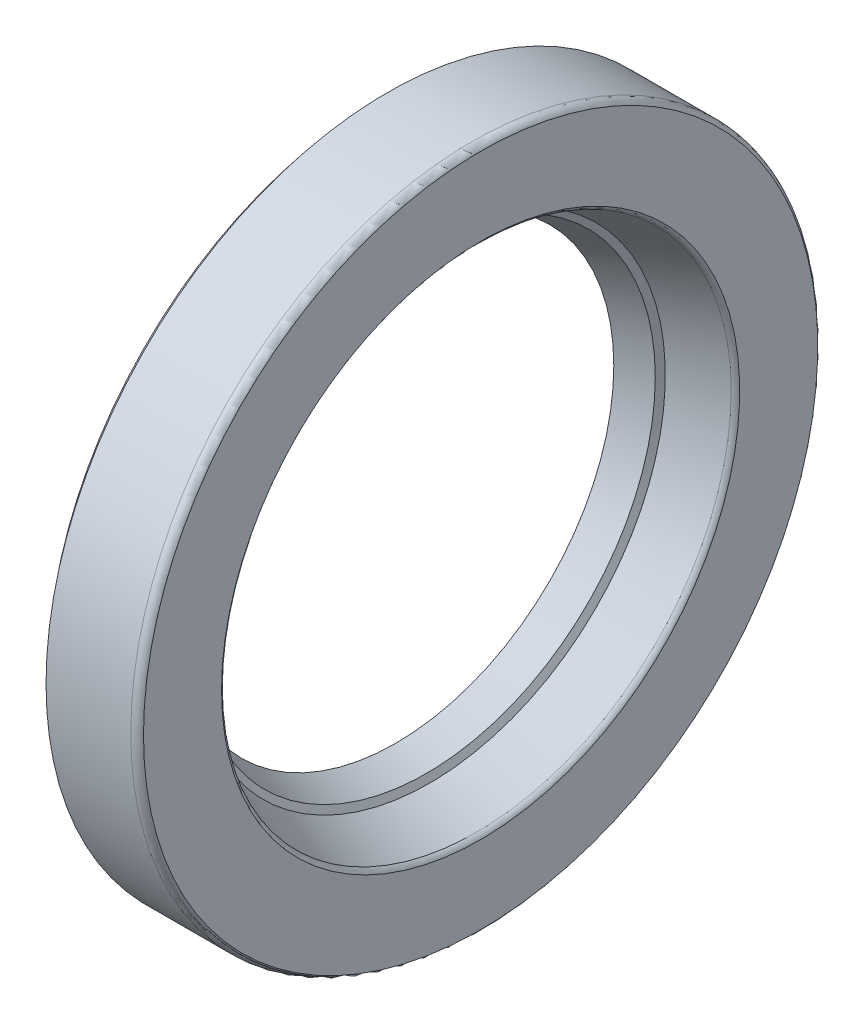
ISO-10303-21;
HEADER;
FILE_DESCRIPTION(('STEP AP214'),'2;1');
FILE_NAME('part.step','',(''),(''),'','','');
FILE_SCHEMA(('AUTOMOTIVE_DESIGN { 1 0 10303 214 1 1 1 1 }'));
ENDSEC;
DATA;
#1=APPLICATION_CONTEXT('core data for automotive mechanical design processes');
#2=APPLICATION_PROTOCOL_DEFINITION('international standard','automotive_design',2000,#1);
#3=PRODUCT_CONTEXT('',#1,'mechanical');
#4=PRODUCT('Part','Part','',(#3));
#5=PRODUCT_RELATED_PRODUCT_CATEGORY('part','',(#4));
#6=PRODUCT_DEFINITION_FORMATION('','',#4);
#7=PRODUCT_DEFINITION_CONTEXT('part definition',#1,'design');
#8=PRODUCT_DEFINITION('design','',#6,#7);
#9=PRODUCT_DEFINITION_SHAPE('','',#8);
#10=(LENGTH_UNIT() NAMED_UNIT(*) SI_UNIT(.MILLI.,.METRE.));
#11=(NAMED_UNIT(*) PLANE_ANGLE_UNIT() SI_UNIT($,.RADIAN.));
#12=(NAMED_UNIT(*) SI_UNIT($,.STERADIAN.) SOLID_ANGLE_UNIT());
#13=UNCERTAINTY_MEASURE_WITH_UNIT(LENGTH_MEASURE(1.E-05),#10,'distance_accuracy_value','');
#14=(GEOMETRIC_REPRESENTATION_CONTEXT(3) GLOBAL_UNCERTAINTY_ASSIGNED_CONTEXT((#13)) GLOBAL_UNIT_ASSIGNED_CONTEXT((#10,
#11,#12)) REPRESENTATION_CONTEXT('',''));
#15=CARTESIAN_POINT('',(0.,0.,0.));
#16=DIRECTION('',(0.,0.,1.));
#17=DIRECTION('',(1.,0.,0.));
#18=AXIS2_PLACEMENT_3D('',#15,#16,#17);
#19=CARTESIAN_POINT('',(0.,0.,0.));
#20=DIRECTION('',(-1.,0.,0.));
#21=DIRECTION('',(0.,0.,0.999999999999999));
#22=AXIS2_PLACEMENT_3D('',#19,#20,#21);
#23=CYLINDRICAL_SURFACE('',#22,23.5);
#24=CARTESIAN_POINT('',(6.41666666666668,0.,0.));
#25=DIRECTION('',(-1.,0.,0.));
#26=DIRECTION('',(0.,0.,0.999999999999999));
#27=AXIS2_PLACEMENT_3D('',#24,#25,#26);
#28=CIRCLE('',#27,23.5);
#29=CARTESIAN_POINT('',(6.41666666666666,0.,23.5));
#30=VERTEX_POINT('',#29);
#31=EDGE_CURVE('E9',#30,#30,#28,.T.);
#32=ORIENTED_EDGE('',*,*,#31,.T.);
#33=EDGE_LOOP('',(#32));
#34=FACE_BOUND('',#33,.T.);
#35=CARTESIAN_POINT('',(0.583333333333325,0.,0.));
#36=DIRECTION('',(-1.,0.,0.));
#37=DIRECTION('',(0.,0.,0.999999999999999));
#38=AXIS2_PLACEMENT_3D('',#35,#36,#37);
#39=CIRCLE('',#38,23.5);
#40=CARTESIAN_POINT('',(0.5833333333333,0.,23.5));
#41=VERTEX_POINT('',#40);
#42=EDGE_CURVE('E68',#41,#41,#39,.T.);
#43=ORIENTED_EDGE('',*,*,#42,.F.);
#44=EDGE_LOOP('',(#43));
#45=FACE_BOUND('',#44,.T.);
#46=ADVANCED_FACE('F13',(#34,#45),#23,.T.);
#47=CARTESIAN_POINT('',(6.49202754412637,0.,0.));
#48=DIRECTION('',(-1.,0.,0.));
#49=DIRECTION('',(0.,0.,0.999999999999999));
#50=AXIS2_PLACEMENT_3D('',#47,#48,#49);
#51=TOROIDAL_SURFACE('',#50,22.9215550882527,0.583333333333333);
#52=ORIENTED_EDGE('',*,*,#31,.F.);
#53=EDGE_LOOP('',(#52));
#54=FACE_BOUND('',#53,.T.);
#55=CARTESIAN_POINT('',(7.00000000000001,0.,0.));
#56=DIRECTION('',(-1.,0.,0.));
#57=DIRECTION('',(0.,0.,0.999999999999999));
#58=AXIS2_PLACEMENT_3D('',#55,#56,#57);
#59=CIRCLE('',#58,23.2083333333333);
#60=CARTESIAN_POINT('',(6.99999999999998,0.,23.2083333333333));
#61=VERTEX_POINT('',#60);
#62=EDGE_CURVE('E19',#61,#61,#59,.T.);
#63=ORIENTED_EDGE('',*,*,#62,.T.);
#64=EDGE_LOOP('',(#63));
#65=FACE_BOUND('',#64,.T.);
#66=ADVANCED_FACE('F76',(#54,#65),#51,.T.);
#67=CARTESIAN_POINT('',(7.00000000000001,23.2083333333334,0.));
#68=DIRECTION('',(1.,0.,0.));
#69=DIRECTION('',(0.,0.,-0.999999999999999));
#70=AXIS2_PLACEMENT_3D('',#67,#68,#69);
#71=PLANE('',#70);
#72=CARTESIAN_POINT('',(7.00000000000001,0.,0.));
#73=DIRECTION('',(-1.,0.,0.));
#74=DIRECTION('',(0.,0.,0.999999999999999));
#75=AXIS2_PLACEMENT_3D('',#72,#73,#74);
#76=CIRCLE('',#75,17.8333333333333);
#77=CARTESIAN_POINT('',(6.99999999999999,0.,17.8333333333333));
#78=VERTEX_POINT('',#77);
#79=EDGE_CURVE('E23',#78,#78,#76,.T.);
#80=ORIENTED_EDGE('',*,*,#79,.T.);
#81=EDGE_LOOP('',(#80));
#82=FACE_BOUND('',#81,.T.);
#83=ORIENTED_EDGE('',*,*,#62,.F.);
#84=EDGE_LOOP('',(#83));
#85=FACE_BOUND('',#84,.T.);
#86=ADVANCED_FACE('F83',(#82,#85),#71,.T.);
#87=CARTESIAN_POINT('',(6.46832793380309,0.,0.));
#88=DIRECTION('',(-1.,0.,0.));
#89=DIRECTION('',(0.,0.,0.999999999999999));
#90=AXIS2_PLACEMENT_3D('',#87,#88,#89);
#91=TOROIDAL_SURFACE('',#90,18.0733387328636,0.583333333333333);
#92=ORIENTED_EDGE('',*,*,#79,.F.);
#93=EDGE_LOOP('',(#92));
#94=FACE_BOUND('',#93,.T.);
#95=CARTESIAN_POINT('',(6.70833333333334,0.,0.));
#96=DIRECTION('',(-1.,0.,0.));
#97=DIRECTION('',(0.,0.,0.999999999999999));
#98=AXIS2_PLACEMENT_3D('',#95,#96,#97);
#99=CIRCLE('',#98,17.5416666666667);
#100=CARTESIAN_POINT('',(6.70833333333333,0.,17.5416666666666));
#101=VERTEX_POINT('',#100);
#102=EDGE_CURVE('E27',#101,#101,#99,.T.);
#103=ORIENTED_EDGE('',*,*,#102,.T.);
#104=EDGE_LOOP('',(#103));
#105=FACE_BOUND('',#104,.T.);
#106=ADVANCED_FACE('F89',(#94,#105),#91,.T.);
#107=CARTESIAN_POINT('',(6.70833333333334,0.,0.));
#108=DIRECTION('',(1.,0.,0.));
#109=DIRECTION('',(0.,0.,-0.999999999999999));
#110=AXIS2_PLACEMENT_3D('',#107,#108,#109);
#111=CONICAL_SURFACE('',#110,17.5416666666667,0.392285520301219);
#112=CARTESIAN_POINT('',(3.5,0.,0.));
#113=DIRECTION('',(-1.,0.,0.));
#114=DIRECTION('',(0.,0.,0.999999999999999));
#115=AXIS2_PLACEMENT_3D('',#112,#113,#114);
#116=CIRCLE('',#115,16.2142857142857);
#117=CARTESIAN_POINT('',(3.49999999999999,0.,16.2142857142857));
#118=VERTEX_POINT('',#117);
#119=EDGE_CURVE('E32',#118,#118,#116,.T.);
#120=ORIENTED_EDGE('',*,*,#119,.T.);
#121=EDGE_LOOP('',(#120));
#122=FACE_BOUND('',#121,.T.);
#123=ORIENTED_EDGE('',*,*,#102,.F.);
#124=EDGE_LOOP('',(#123));
#125=FACE_BOUND('',#124,.T.);
#126=ADVANCED_FACE('F95',(#122,#125),#111,.F.);
#127=CARTESIAN_POINT('',(3.5,0.,0.));
#128=DIRECTION('',(1.,0.,0.));
#129=DIRECTION('',(0.,0.,-0.999999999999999));
#130=AXIS2_PLACEMENT_3D('',#127,#128,#129);
#131=CONICAL_SURFACE('',#130,16.2142857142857,1.10025227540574);
#132=CARTESIAN_POINT('',(3.26666666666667,0.,0.));
#133=DIRECTION('',(-1.,0.,0.));
#134=DIRECTION('',(0.,0.,0.999999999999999));
#135=AXIS2_PLACEMENT_3D('',#132,#133,#134);
#136=CIRCLE('',#135,15.7555555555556);
#137=CARTESIAN_POINT('',(3.26666666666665,0.,15.7555555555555));
#138=VERTEX_POINT('',#137);
#139=EDGE_CURVE('E35',#138,#138,#136,.T.);
#140=ORIENTED_EDGE('',*,*,#139,.T.);
#141=EDGE_LOOP('',(#140));
#142=FACE_BOUND('',#141,.T.);
#143=ORIENTED_EDGE('',*,*,#119,.F.);
#144=EDGE_LOOP('',(#143));
#145=FACE_BOUND('',#144,.T.);
#146=ADVANCED_FACE('F99',(#142,#145),#131,.F.);
#147=CARTESIAN_POINT('',(3.26666666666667,0.,0.));
#148=DIRECTION('',(1.,0.,0.));
#149=DIRECTION('',(0.,0.,-0.999999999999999));
#150=AXIS2_PLACEMENT_3D('',#147,#148,#149);
#151=CONICAL_SURFACE('',#150,15.7555555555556,0.345368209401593);
#152=CARTESIAN_POINT('',(1.16666666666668,0.,0.));
#153=DIRECTION('',(-1.,0.,0.));
#154=DIRECTION('',(0.,0.,0.999999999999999));
#155=AXIS2_PLACEMENT_3D('',#152,#153,#154);
#156=CIRCLE('',#155,15.);
#157=CARTESIAN_POINT('',(1.16666666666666,0.,15.));
#158=VERTEX_POINT('',#157);
#159=EDGE_CURVE('E38',#158,#158,#156,.T.);
#160=ORIENTED_EDGE('',*,*,#159,.T.);
#161=EDGE_LOOP('',(#160));
#162=FACE_BOUND('',#161,.T.);
#163=ORIENTED_EDGE('',*,*,#139,.F.);
#164=EDGE_LOOP('',(#163));
#165=FACE_BOUND('',#164,.T.);
#166=ADVANCED_FACE('F103',(#162,#165),#151,.F.);
#167=CARTESIAN_POINT('',(1.16666666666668,0.,0.));
#168=DIRECTION('',(-1.,0.,0.));
#169=DIRECTION('',(0.,0.,0.999999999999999));
#170=AXIS2_PLACEMENT_3D('',#167,#168,#169);
#171=CONICAL_SURFACE('',#170,15.,1.04785756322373);
#172=CARTESIAN_POINT('',(0.466666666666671,0.,0.));
#173=DIRECTION('',(-1.,0.,0.));
#174=DIRECTION('',(0.,0.,0.999999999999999));
#175=AXIS2_PLACEMENT_3D('',#172,#173,#174);
#176=CIRCLE('',#175,16.2142857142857);
#177=CARTESIAN_POINT('',(0.466666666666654,0.,16.2142857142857));
#178=VERTEX_POINT('',#177);
#179=EDGE_CURVE('E41',#178,#178,#176,.T.);
#180=ORIENTED_EDGE('',*,*,#179,.T.);
#181=EDGE_LOOP('',(#180));
#182=FACE_BOUND('',#181,.T.);
#183=ORIENTED_EDGE('',*,*,#159,.F.);
#184=EDGE_LOOP('',(#183));
#185=FACE_BOUND('',#184,.T.);
#186=ADVANCED_FACE('F107',(#182,#185),#171,.F.);
#187=CARTESIAN_POINT('',(0.466666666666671,16.2142857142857,0.));
#188=DIRECTION('',(-1.,0.,0.));
#189=DIRECTION('',(0.,0.,0.999999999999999));
#190=AXIS2_PLACEMENT_3D('',#187,#188,#189);
#191=PLANE('',#190);
#192=CARTESIAN_POINT('',(0.466666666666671,0.,0.));
#193=DIRECTION('',(-1.,0.,0.));
#194=DIRECTION('',(0.,0.,0.999999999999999));
#195=AXIS2_PLACEMENT_3D('',#192,#193,#194);
#196=CIRCLE('',#195,17.9927827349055);
#197=CARTESIAN_POINT('',(0.466666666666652,0.,17.9927827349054));
#198=VERTEX_POINT('',#197);
#199=EDGE_CURVE('E44',#198,#198,#196,.T.);
#200=ORIENTED_EDGE('',*,*,#199,.T.);
#201=EDGE_LOOP('',(#200));
#202=FACE_BOUND('',#201,.T.);
#203=ORIENTED_EDGE('',*,*,#179,.F.);
#204=EDGE_LOOP('',(#203));
#205=FACE_BOUND('',#204,.T.);
#206=ADVANCED_FACE('F111',(#202,#205),#191,.T.);
#207=CARTESIAN_POINT('',(0.,0.,0.));
#208=DIRECTION('',(-1.,0.,0.));
#209=DIRECTION('',(0.,0.,0.999999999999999));
#210=AXIS2_PLACEMENT_3D('',#207,#208,#209);
#211=CYLINDRICAL_SURFACE('',#210,17.9927827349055);
#212=CARTESIAN_POINT('',(1.32971363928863,0.,0.));
#213=DIRECTION('',(-1.,0.,0.));
#214=DIRECTION('',(0.,0.,0.999999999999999));
#215=AXIS2_PLACEMENT_3D('',#212,#213,#214);
#216=CIRCLE('',#215,17.9927827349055);
#217=CARTESIAN_POINT('',(1.32971363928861,0.,17.9927827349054));
#218=VERTEX_POINT('',#217);
#219=EDGE_CURVE('E47',#218,#218,#216,.T.);
#220=ORIENTED_EDGE('',*,*,#219,.T.);
#221=EDGE_LOOP('',(#220));
#222=FACE_BOUND('',#221,.T.);
#223=ORIENTED_EDGE('',*,*,#199,.F.);
#224=EDGE_LOOP('',(#223));
#225=FACE_BOUND('',#224,.T.);
#226=ADVANCED_FACE('F115',(#222,#225),#211,.T.);
#227=CARTESIAN_POINT('',(1.75,0.,0.));
#228=DIRECTION('',(-1.,0.,0.));
#229=DIRECTION('',(0.,0.,0.999999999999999));
#230=AXIS2_PLACEMENT_3D('',#227,#228,#229);
#231=TOROIDAL_SURFACE('',#230,17.125,0.964203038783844);
#232=ORIENTED_EDGE('',*,*,#219,.F.);
#233=EDGE_LOOP('',(#232));
#234=FACE_BOUND('',#233,.T.);
#235=CARTESIAN_POINT('',(2.67626751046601,0.,0.));
#236=DIRECTION('',(-1.,0.,0.));
#237=DIRECTION('',(0.,0.,0.999999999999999));
#238=AXIS2_PLACEMENT_3D('',#235,#236,#237);
#239=CIRCLE('',#238,17.3927984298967);
#240=CARTESIAN_POINT('',(2.67626751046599,0.,17.3927984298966));
#241=VERTEX_POINT('',#240);
#242=EDGE_CURVE('E50',#241,#241,#239,.T.);
#243=ORIENTED_EDGE('',*,*,#242,.T.);
#244=EDGE_LOOP('',(#243));
#245=FACE_BOUND('',#244,.T.);
#246=ADVANCED_FACE('F119',(#234,#245),#231,.T.);
#247=CARTESIAN_POINT('',(4.20000000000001,0.,0.));
#248=DIRECTION('',(1.,0.,0.));
#249=DIRECTION('',(0.,0.,-0.999999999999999));
#250=AXIS2_PLACEMENT_3D('',#247,#248,#249);
#251=CONICAL_SURFACE('',#250,17.8333333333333,0.281441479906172);
#252=ORIENTED_EDGE('',*,*,#242,.F.);
#253=EDGE_LOOP('',(#252));
#254=FACE_BOUND('',#253,.T.);
#255=CARTESIAN_POINT('',(4.20000000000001,0.,0.));
#256=DIRECTION('',(-1.,0.,0.));
#257=DIRECTION('',(0.,0.,0.999999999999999));
#258=AXIS2_PLACEMENT_3D('',#255,#256,#257);
#259=CIRCLE('',#258,17.8333333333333);
#260=CARTESIAN_POINT('',(4.19999999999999,0.,17.8333333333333));
#261=VERTEX_POINT('',#260);
#262=EDGE_CURVE('E53',#261,#261,#259,.T.);
#263=ORIENTED_EDGE('',*,*,#262,.T.);
#264=EDGE_LOOP('',(#263));
#265=FACE_BOUND('',#264,.T.);
#266=ADVANCED_FACE('F123',(#254,#265),#251,.T.);
#267=CARTESIAN_POINT('',(4.20000000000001,21.0833333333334,0.));
#268=DIRECTION('',(1.,0.,0.));
#269=DIRECTION('',(0.,0.,-0.999999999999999));
#270=AXIS2_PLACEMENT_3D('',#267,#268,#269);
#271=PLANE('',#270);
#272=ORIENTED_EDGE('',*,*,#262,.F.);
#273=EDGE_LOOP('',(#272));
#274=FACE_BOUND('',#273,.T.);
#275=CARTESIAN_POINT('',(4.20000000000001,0.,0.));
#276=DIRECTION('',(-1.,0.,0.));
#277=DIRECTION('',(0.,0.,0.999999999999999));
#278=AXIS2_PLACEMENT_3D('',#275,#276,#277);
#279=CIRCLE('',#278,21.0833333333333);
#280=CARTESIAN_POINT('',(4.19999999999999,0.,21.0833333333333));
#281=VERTEX_POINT('',#280);
#282=EDGE_CURVE('E56',#281,#281,#279,.T.);
#283=ORIENTED_EDGE('',*,*,#282,.T.);
#284=EDGE_LOOP('',(#283));
#285=FACE_BOUND('',#284,.T.);
#286=ADVANCED_FACE('F127',(#274,#285),#271,.F.);
#287=CARTESIAN_POINT('',(3.66832793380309,0.,0.));
#288=DIRECTION('',(-1.,0.,0.));
#289=DIRECTION('',(0.,0.,0.999999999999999));
#290=AXIS2_PLACEMENT_3D('',#287,#288,#289);
#291=TOROIDAL_SURFACE('',#290,20.8433279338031,0.583333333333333);
#292=CARTESIAN_POINT('',(3.90833333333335,0.,0.));
#293=DIRECTION('',(-1.,0.,0.));
#294=DIRECTION('',(0.,0.,0.999999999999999));
#295=AXIS2_PLACEMENT_3D('',#292,#293,#294);
#296=CIRCLE('',#295,21.375);
#297=CARTESIAN_POINT('',(3.90833333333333,0.,21.375));
#298=VERTEX_POINT('',#297);
#299=EDGE_CURVE('E59',#298,#298,#296,.T.);
#300=ORIENTED_EDGE('',*,*,#299,.T.);
#301=EDGE_LOOP('',(#300));
#302=FACE_BOUND('',#301,.T.);
#303=ORIENTED_EDGE('',*,*,#282,.F.);
#304=EDGE_LOOP('',(#303));
#305=FACE_BOUND('',#304,.T.);
#306=ADVANCED_FACE('F131',(#302,#305),#291,.F.);
#307=CARTESIAN_POINT('',(0.,0.,0.));
#308=DIRECTION('',(-1.,0.,0.));
#309=DIRECTION('',(0.,0.,0.999999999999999));
#310=AXIS2_PLACEMENT_3D('',#307,#308,#309);
#311=CONICAL_SURFACE('',#310,21.8,0.108316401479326);
#312=ORIENTED_EDGE('',*,*,#299,.F.);
#313=EDGE_LOOP('',(#312));
#314=FACE_BOUND('',#313,.T.);
#315=CARTESIAN_POINT('',(0.,0.,0.));
#316=DIRECTION('',(-1.,0.,0.));
#317=DIRECTION('',(0.,0.,0.999999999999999));
#318=AXIS2_PLACEMENT_3D('',#315,#316,#317);
#319=CIRCLE('',#318,21.8);
#320=CARTESIAN_POINT('',(0.,0.,21.8));
#321=VERTEX_POINT('',#320);
#322=EDGE_CURVE('E62',#321,#321,#319,.T.);
#323=ORIENTED_EDGE('',*,*,#322,.T.);
#324=EDGE_LOOP('',(#323));
#325=FACE_BOUND('',#324,.T.);
#326=ADVANCED_FACE('F135',(#314,#325),#311,.F.);
#327=CARTESIAN_POINT('',(0.,21.8,0.));
#328=DIRECTION('',(-1.,0.,0.));
#329=DIRECTION('',(0.,0.,0.999999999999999));
#330=AXIS2_PLACEMENT_3D('',#327,#328,#329);
#331=PLANE('',#330);
#332=CARTESIAN_POINT('',(0.,0.,0.));
#333=DIRECTION('',(-1.,0.,0.));
#334=DIRECTION('',(0.,0.,0.999999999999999));
#335=AXIS2_PLACEMENT_3D('',#332,#333,#334);
#336=CIRCLE('',#335,22.7916666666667);
#337=CARTESIAN_POINT('',(0.,0.,22.7916666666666));
#338=VERTEX_POINT('',#337);
#339=EDGE_CURVE('E65',#338,#338,#336,.T.);
#340=ORIENTED_EDGE('',*,*,#339,.T.);
#341=EDGE_LOOP('',(#340));
#342=FACE_BOUND('',#341,.T.);
#343=ORIENTED_EDGE('',*,*,#322,.F.);
#344=EDGE_LOOP('',(#343));
#345=FACE_BOUND('',#344,.T.);
#346=ADVANCED_FACE('F139',(#342,#345),#331,.T.);
#347=CARTESIAN_POINT('',(0.,0.,0.));
#348=DIRECTION('',(1.,0.,0.));
#349=DIRECTION('',(0.,0.,-0.999999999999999));
#350=AXIS2_PLACEMENT_3D('',#347,#348,#349);
#351=CONICAL_SURFACE('',#350,22.7916666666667,0.881871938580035);
#352=ORIENTED_EDGE('',*,*,#42,.T.);
#353=EDGE_LOOP('',(#352));
#354=FACE_BOUND('',#353,.T.);
#355=ORIENTED_EDGE('',*,*,#339,.F.);
#356=EDGE_LOOP('',(#355));
#357=FACE_BOUND('',#356,.T.);
#358=ADVANCED_FACE('F72',(#354,#357),#351,.T.);
#359=CLOSED_SHELL('',(#46,#66,#86,#106,#126,#146,#166,#186,#206,#226,#246,#266,#286,#306,#326,
#346,#358));
#360=MANIFOLD_SOLID_BREP('B1',#359);
#361=ADVANCED_BREP_SHAPE_REPRESENTATION('',(#18,#360),#14);
#362=SHAPE_DEFINITION_REPRESENTATION(#9,#361);
ENDSEC;
END-ISO-10303-21;
